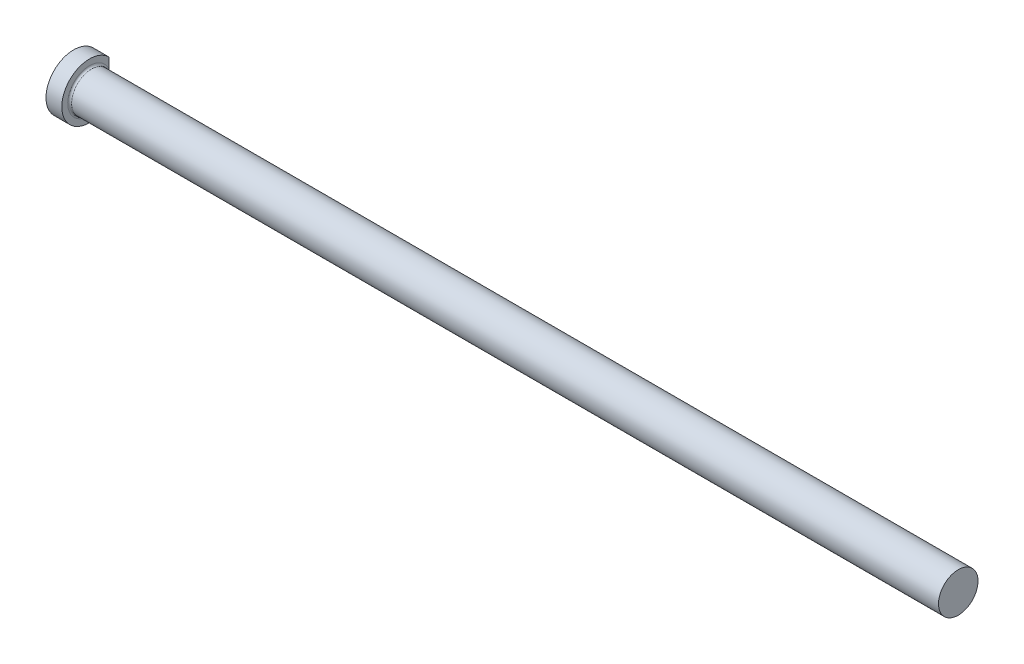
ISO-10303-21;
HEADER;
FILE_DESCRIPTION(('STEP AP214'),'2;1');
FILE_NAME('part.step','',(''),(''),'','','');
FILE_SCHEMA(('AUTOMOTIVE_DESIGN { 1 0 10303 214 1 1 1 1 }'));
ENDSEC;
DATA;
#1=APPLICATION_CONTEXT('core data for automotive mechanical design processes');
#2=APPLICATION_PROTOCOL_DEFINITION('international standard','automotive_design',2000,#1);
#3=PRODUCT_CONTEXT('',#1,'mechanical');
#4=PRODUCT('Part','Part','',(#3));
#5=PRODUCT_RELATED_PRODUCT_CATEGORY('part','',(#4));
#6=PRODUCT_DEFINITION_FORMATION('','',#4);
#7=PRODUCT_DEFINITION_CONTEXT('part definition',#1,'design');
#8=PRODUCT_DEFINITION('design','',#6,#7);
#9=PRODUCT_DEFINITION_SHAPE('','',#8);
#10=(LENGTH_UNIT() NAMED_UNIT(*) SI_UNIT(.MILLI.,.METRE.));
#11=(NAMED_UNIT(*) PLANE_ANGLE_UNIT() SI_UNIT($,.RADIAN.));
#12=(NAMED_UNIT(*) SI_UNIT($,.STERADIAN.) SOLID_ANGLE_UNIT());
#13=UNCERTAINTY_MEASURE_WITH_UNIT(LENGTH_MEASURE(1.E-05),#10,'distance_accuracy_value','');
#14=(GEOMETRIC_REPRESENTATION_CONTEXT(3) GLOBAL_UNCERTAINTY_ASSIGNED_CONTEXT((#13)) GLOBAL_UNIT_ASSIGNED_CONTEXT((#10,
#11,#12)) REPRESENTATION_CONTEXT('',''));
#15=CARTESIAN_POINT('',(0.,0.,0.));
#16=DIRECTION('',(0.,0.,1.));
#17=DIRECTION('',(1.,0.,0.));
#18=AXIS2_PLACEMENT_3D('',#15,#16,#17);
#19=CARTESIAN_POINT('',(0.,0.,0.));
#20=DIRECTION('',(1.,0.,0.));
#21=DIRECTION('',(0.,1.,0.));
#22=AXIS2_PLACEMENT_3D('',#19,#20,#21);
#23=PLANE('',#22);
#24=DIRECTION('',(0.,1.,0.));
#25=VECTOR('',#24,1.);
#26=CARTESIAN_POINT('',(0.,0.,-7.93775399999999));
#27=LINE('',#26,#25);
#28=CARTESIAN_POINT('',(0.,-7.77687068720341,-7.93775399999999));
#29=VERTEX_POINT('',#28);
#30=CARTESIAN_POINT('',(0.,7.77687068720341,-7.93775399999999));
#31=VERTEX_POINT('',#30);
#32=EDGE_CURVE('E49',#29,#31,#27,.T.);
#33=ORIENTED_EDGE('',*,*,#32,.F.);
#34=CARTESIAN_POINT('',(0.,0.,0.));
#35=DIRECTION('',(-1.,0.,0.));
#36=DIRECTION('',(0.,-1.,0.));
#37=AXIS2_PLACEMENT_3D('',#34,#35,#36);
#38=CIRCLE('',#37,11.1125);
#39=EDGE_CURVE('E43',#29,#31,#38,.T.);
#40=ORIENTED_EDGE('',*,*,#39,.T.);
#41=EDGE_LOOP('',(#33,#40));
#42=FACE_BOUND('',#41,.T.);
#43=ADVANCED_FACE('F32',(#42),#23,.F.);
#44=CARTESIAN_POINT('',(355.6,0.,0.));
#45=DIRECTION('',(-1.,0.,0.));
#46=DIRECTION('',(0.,-1.,0.));
#47=AXIS2_PLACEMENT_3D('',#44,#45,#46);
#48=CYLINDRICAL_SURFACE('',#47,11.1125);
#49=DIRECTION('',(-1.,0.,0.));
#50=VECTOR('',#49,1.);
#51=CARTESIAN_POINT('',(355.6,-7.7768706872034,-7.93775399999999));
#52=LINE('',#51,#50);
#53=CARTESIAN_POINT('',(6.35000000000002,-7.77687068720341,-7.93775399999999));
#54=VERTEX_POINT('',#53);
#55=EDGE_CURVE('E87',#54,#29,#52,.T.);
#56=ORIENTED_EDGE('',*,*,#55,.F.);
#57=CARTESIAN_POINT('',(6.35000000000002,0.,0.));
#58=DIRECTION('',(-1.,0.,0.));
#59=DIRECTION('',(0.,-1.,0.));
#60=AXIS2_PLACEMENT_3D('',#57,#58,#59);
#61=CIRCLE('',#60,11.1125);
#62=CARTESIAN_POINT('',(6.35000000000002,7.77687068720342,-7.93775399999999));
#63=VERTEX_POINT('',#62);
#64=EDGE_CURVE('E75',#54,#63,#61,.T.);
#65=ORIENTED_EDGE('',*,*,#64,.T.);
#66=DIRECTION('',(-1.,0.,0.));
#67=VECTOR('',#66,1.);
#68=CARTESIAN_POINT('',(355.6,7.77687068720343,-7.93775399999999));
#69=LINE('',#68,#67);
#70=EDGE_CURVE('E56',#31,#63,#69,.F.);
#71=ORIENTED_EDGE('',*,*,#70,.F.);
#72=ORIENTED_EDGE('',*,*,#39,.F.);
#73=EDGE_LOOP('',(#56,#65,#71,#72));
#74=FACE_BOUND('',#73,.T.);
#75=ADVANCED_FACE('F97',(#74),#48,.T.);
#76=CARTESIAN_POINT('',(6.35,11.1125,0.));
#77=DIRECTION('',(-1.,0.,0.));
#78=DIRECTION('',(0.,-1.,0.));
#79=AXIS2_PLACEMENT_3D('',#76,#77,#78);
#80=PLANE('',#79);
#81=DIRECTION('',(0.,-1.,0.));
#82=VECTOR('',#81,1.);
#83=CARTESIAN_POINT('',(6.35,11.1125,-7.93775399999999));
#84=LINE('',#83,#82);
#85=CARTESIAN_POINT('',(6.35000000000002,3.62159377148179,-7.93775399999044));
#86=VERTEX_POINT('',#85);
#87=EDGE_CURVE('E84',#63,#86,#84,.T.);
#88=ORIENTED_EDGE('',*,*,#87,.F.);
#89=ORIENTED_EDGE('',*,*,#64,.F.);
#90=CARTESIAN_POINT('',(6.35,-3.62159377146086,-7.93775399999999));
#91=VERTEX_POINT('',#90);
#92=EDGE_CURVE('E80',#91,#54,#84,.T.);
#93=ORIENTED_EDGE('',*,*,#92,.F.);
#94=CARTESIAN_POINT('',(6.35000000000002,0.,0.));
#95=DIRECTION('',(-1.,0.,0.));
#96=DIRECTION('',(0.,-1.,0.));
#97=AXIS2_PLACEMENT_3D('',#94,#95,#96);
#98=CIRCLE('',#97,8.7249);
#99=EDGE_CURVE('E70',#91,#86,#98,.T.);
#100=ORIENTED_EDGE('',*,*,#99,.T.);
#101=EDGE_LOOP('',(#88,#89,#93,#100));
#102=FACE_BOUND('',#101,.T.);
#103=ADVANCED_FACE('F81',(#102),#80,.F.);
#104=CARTESIAN_POINT('',(7.1374,0.,0.));
#105=DIRECTION('',(-1.,0.,0.));
#106=DIRECTION('',(0.,-1.,0.));
#107=AXIS2_PLACEMENT_3D('',#104,#105,#106);
#108=TOROIDAL_SURFACE('',#107,8.7249,0.787400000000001);
#109=CARTESIAN_POINT('',(7.13740000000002,0.,0.));
#110=DIRECTION('',(-1.,0.,0.));
#111=DIRECTION('',(0.,-1.,0.));
#112=AXIS2_PLACEMENT_3D('',#109,#110,#111);
#113=CIRCLE('',#112,7.9375);
#114=CARTESIAN_POINT('',(7.13740000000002,-7.9375,0.));
#115=VERTEX_POINT('',#114);
#116=EDGE_CURVE('E76',#115,#115,#113,.T.);
#117=ORIENTED_EDGE('',*,*,#116,.T.);
#118=EDGE_LOOP('',(#117));
#119=FACE_BOUND('',#118,.T.);
#120=CARTESIAN_POINT('',(7.11740163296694,0.,-7.93775399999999));
#121=CARTESIAN_POINT('',(7.11739465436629,-0.00831875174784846,-7.93775399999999));
#122=CARTESIAN_POINT('',(7.11686254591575,-0.0166605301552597,-7.93775399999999));
#123=CARTESIAN_POINT('',(7.1149628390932,-0.0332562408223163,-7.93775399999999));
#124=CARTESIAN_POINT('',(7.11359203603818,-0.041509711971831,-7.93775399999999));
#125=CARTESIAN_POINT('',(7.10880536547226,-0.0662282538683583,-7.93775399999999));
#126=CARTESIAN_POINT('',(7.10472327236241,-0.0825567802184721,-7.93775399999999));
#127=CARTESIAN_POINT('',(7.09173043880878,-0.131601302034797,-7.93775399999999));
#128=CARTESIAN_POINT('',(7.08212745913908,-0.16411222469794,-7.93775399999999));
#129=CARTESIAN_POINT('',(7.0625066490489,-0.229574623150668,-7.93775399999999));
#130=CARTESIAN_POINT('',(7.05248465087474,-0.262524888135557,-7.93775399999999));
#131=CARTESIAN_POINT('',(7.03238611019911,-0.328216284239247,-7.93775399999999));
#132=CARTESIAN_POINT('',(7.02231014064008,-0.360957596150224,-7.93775399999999));
#133=CARTESIAN_POINT('',(6.96866765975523,-0.535318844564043,-7.93775399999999));
#134=CARTESIAN_POINT('',(6.92514937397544,-0.676958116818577,-7.93775399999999));
#135=CARTESIAN_POINT('',(6.83988094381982,-0.961071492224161,-7.93775399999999));
#136=CARTESIAN_POINT('',(6.79813454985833,-1.10354670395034,-7.93775399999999));
#137=CARTESIAN_POINT('',(6.67787276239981,-1.53003573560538,-7.93775399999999));
#138=CARTESIAN_POINT('',(6.60361032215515,-1.8153329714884,-7.93775399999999));
#139=CARTESIAN_POINT('',(6.50819856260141,-2.24883675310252,-7.93775399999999));
#140=CARTESIAN_POINT('',(6.47892220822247,-2.39522816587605,-7.93775399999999));
#141=CARTESIAN_POINT('',(6.42778660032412,-2.68927327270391,-7.93775399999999));
#142=CARTESIAN_POINT('',(6.40592469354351,-2.83692649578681,-7.93775399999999));
#143=CARTESIAN_POINT('',(6.37184973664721,-3.13335997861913,-7.93775399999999));
#144=CARTESIAN_POINT('',(6.35963255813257,-3.28213972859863,-7.93775399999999));
#145=CARTESIAN_POINT('',(6.35089317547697,-3.50560390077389,-7.93775399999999));
#146=CARTESIAN_POINT('',(6.34957585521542,-3.58009961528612,-7.93775399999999));
#147=CARTESIAN_POINT('',(6.35066403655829,-3.72905818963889,-7.93775399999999));
#148=CARTESIAN_POINT('',(6.35306949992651,-3.803521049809,-7.93775399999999));
#149=CARTESIAN_POINT('',(6.36488123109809,-3.9954722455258,-7.93775399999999));
#150=CARTESIAN_POINT('',(6.37754340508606,-4.11281818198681,-7.93775399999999));
#151=CARTESIAN_POINT('',(6.40731512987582,-4.28685788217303,-7.93775399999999));
#152=CARTESIAN_POINT('',(6.41901868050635,-4.34448561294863,-7.93775399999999));
#153=CARTESIAN_POINT('',(6.44665424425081,-4.45870626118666,-7.93775399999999));
#154=CARTESIAN_POINT('',(6.46258356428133,-4.51529981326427,-7.93775399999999));
#155=CARTESIAN_POINT('',(6.49967314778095,-4.62746604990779,-7.93775399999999));
#156=CARTESIAN_POINT('',(6.52088899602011,-4.68302067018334,-7.93775399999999));
#157=CARTESIAN_POINT('',(6.56957225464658,-4.79142309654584,-7.93775399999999));
#158=CARTESIAN_POINT('',(6.59704016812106,-4.84427068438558,-7.93775399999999));
#159=CARTESIAN_POINT('',(6.65288973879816,-4.93444333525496,-7.93775399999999));
#160=CARTESIAN_POINT('',(6.67980774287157,-4.97266427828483,-7.93775399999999));
#161=CARTESIAN_POINT('',(6.73912570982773,-5.04461733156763,-7.93775399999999));
#162=CARTESIAN_POINT('',(6.77151267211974,-5.078359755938,-7.93775399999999));
#163=CARTESIAN_POINT('',(6.83001641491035,-5.1283462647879,-7.93775399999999));
#164=CARTESIAN_POINT('',(6.85440789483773,-5.14659888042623,-7.93775399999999));
#165=CARTESIAN_POINT('',(6.90572230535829,-5.17913635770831,-7.93775399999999));
#166=CARTESIAN_POINT('',(6.93264181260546,-5.19342648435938,-7.93775399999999));
#167=CARTESIAN_POINT('',(6.98430509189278,-5.2151304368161,-7.93775399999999));
#168=CARTESIAN_POINT('',(7.0087432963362,-5.22326519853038,-7.93775399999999));
#169=CARTESIAN_POINT('',(7.05864365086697,-5.23531281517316,-7.93775399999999));
#170=CARTESIAN_POINT('',(7.0841050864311,-5.23922856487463,-7.93775399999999));
#171=CARTESIAN_POINT('',(7.13539651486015,-5.24250311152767,-7.93775399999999));
#172=CARTESIAN_POINT('',(7.16122734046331,-5.24184911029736,-7.93775399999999));
#173=CARTESIAN_POINT('',(7.21237124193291,-5.23601437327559,-7.93775399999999));
#174=CARTESIAN_POINT('',(7.2376841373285,-5.23083208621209,-7.93775399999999));
#175=CARTESIAN_POINT('',(7.28619810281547,-5.21664602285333,-7.93775399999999));
#176=CARTESIAN_POINT('',(7.30944244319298,-5.20778727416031,-7.93775399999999));
#177=CARTESIAN_POINT('',(7.35441891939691,-5.18685621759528,-7.93775399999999));
#178=CARTESIAN_POINT('',(7.37615048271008,-5.17478270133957,-7.93775399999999));
#179=CARTESIAN_POINT('',(7.42999305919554,-5.14028416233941,-7.93775399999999));
#180=CARTESIAN_POINT('',(7.4608530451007,-5.11590713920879,-7.93775399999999));
#181=CARTESIAN_POINT('',(7.51837561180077,-5.06262060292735,-7.93775399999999));
#182=CARTESIAN_POINT('',(7.54502615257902,-5.033698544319,-7.93775399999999));
#183=CARTESIAN_POINT('',(7.61009423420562,-4.95353967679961,-7.93775399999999));
#184=CARTESIAN_POINT('',(7.64532674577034,-4.89973711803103,-7.93775399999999));
#185=CARTESIAN_POINT('',(7.70752548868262,-4.78761031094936,-7.93775399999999));
#186=CARTESIAN_POINT('',(7.73447207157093,-4.72927571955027,-7.93775399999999));
#187=CARTESIAN_POINT('',(7.78036596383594,-4.61331334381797,-7.93775399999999));
#188=CARTESIAN_POINT('',(7.79967345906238,-4.55582513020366,-7.93775399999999));
#189=CARTESIAN_POINT('',(7.83335443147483,-4.4393972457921,-7.93775399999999));
#190=CARTESIAN_POINT('',(7.84772344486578,-4.38045631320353,-7.93775399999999));
#191=CARTESIAN_POINT('',(7.87231446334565,-4.26162941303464,-7.93775399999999));
#192=CARTESIAN_POINT('',(7.88252946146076,-4.20174202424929,-7.93775399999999));
#193=CARTESIAN_POINT('',(7.89938430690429,-4.08149980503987,-7.93775399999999));
#194=CARTESIAN_POINT('',(7.90602535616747,-4.02114513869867,-7.93775399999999));
#195=CARTESIAN_POINT('',(7.91794338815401,-3.8798093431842,-7.93775399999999));
#196=CARTESIAN_POINT('',(7.92200783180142,-3.79872681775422,-7.93775399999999));
#197=CARTESIAN_POINT('',(7.92553011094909,-3.63645129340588,-7.93775399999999));
#198=CARTESIAN_POINT('',(7.92498603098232,-3.55525826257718,-7.93775399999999));
#199=CARTESIAN_POINT('',(7.91751319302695,-3.31163407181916,-7.93775399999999));
#200=CARTESIAN_POINT('',(7.90472943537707,-3.14937912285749,-7.93775399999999));
#201=CARTESIAN_POINT('',(7.8676917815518,-2.82609889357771,-7.93775399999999));
#202=CARTESIAN_POINT('',(7.84342332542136,-2.66507543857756,-7.93775399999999));
#203=CARTESIAN_POINT('',(7.78631819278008,-2.3447455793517,-7.93775399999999));
#204=CARTESIAN_POINT('',(7.75348989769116,-2.18543765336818,-7.93775399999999));
#205=CARTESIAN_POINT('',(7.69810689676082,-1.94158094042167,-7.93775399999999));
#206=CARTESIAN_POINT('',(7.67781446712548,-1.85650278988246,-7.93775399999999));
#207=CARTESIAN_POINT('',(7.63565239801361,-1.68665587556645,-7.93775399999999));
#208=CARTESIAN_POINT('',(7.61378135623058,-1.60188745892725,-7.93775399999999));
#209=CARTESIAN_POINT('',(7.56848359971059,-1.43170349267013,-7.93775399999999));
#210=CARTESIAN_POINT('',(7.54504163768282,-1.34629202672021,-7.93775399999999));
#211=CARTESIAN_POINT('',(7.49717210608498,-1.1760530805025,-7.93775399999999));
#212=CARTESIAN_POINT('',(7.47274807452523,-1.09122460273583,-7.93775399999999));
#213=CARTESIAN_POINT('',(7.43520501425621,-0.96314952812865,-7.93775399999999));
#214=CARTESIAN_POINT('',(7.42238621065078,-0.919814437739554,-7.93775399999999));
#215=CARTESIAN_POINT('',(7.39655831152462,-0.833163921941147,-7.93775399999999));
#216=CARTESIAN_POINT('',(7.38354907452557,-0.789848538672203,-7.93775399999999));
#217=CARTESIAN_POINT('',(7.35720005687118,-0.702651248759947,-7.93775399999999));
#218=CARTESIAN_POINT('',(7.34385820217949,-0.65876997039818,-7.93775399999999));
#219=CARTESIAN_POINT('',(7.31710763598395,-0.571170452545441,-7.93775399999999));
#220=CARTESIAN_POINT('',(7.30369924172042,-0.527452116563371,-7.93775399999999));
#221=CARTESIAN_POINT('',(7.27743659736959,-0.442022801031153,-7.93775399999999));
#222=CARTESIAN_POINT('',(7.26458489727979,-0.400311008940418,-7.93775399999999));
#223=CARTESIAN_POINT('',(7.23880152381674,-0.316406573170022,-7.93775399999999));
#224=CARTESIAN_POINT('',(7.22587053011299,-0.274213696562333,-7.93775399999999));
#225=CARTESIAN_POINT('',(7.20072921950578,-0.191353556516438,-7.93775399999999));
#226=CARTESIAN_POINT('',(7.18851010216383,-0.150688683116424,-7.93775399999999));
#227=CARTESIAN_POINT('',(7.1718383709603,-0.0896856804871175,-7.93775399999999));
#228=CARTESIAN_POINT('',(7.16660973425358,-0.0695879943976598,-7.93775399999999));
#229=CARTESIAN_POINT('',(7.16076608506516,-0.0391365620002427,-7.93775399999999));
#230=CARTESIAN_POINT('',(7.15915541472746,-0.0289999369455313,-7.93775399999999));
#231=CARTESIAN_POINT('',(7.15735845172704,-0.00861600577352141,-7.93775399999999));
#232=CARTESIAN_POINT('',(7.15716659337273,0.00163070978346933,-7.93775399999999));
#233=CARTESIAN_POINT('',(7.15832829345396,0.0222087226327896,-7.93775399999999));
#234=CARTESIAN_POINT('',(7.15971060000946,0.0325380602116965,-7.93775399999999));
#235=CARTESIAN_POINT('',(7.16332304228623,0.0530730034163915,-7.93775399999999));
#236=CARTESIAN_POINT('',(7.16555705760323,0.063277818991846,-7.93775399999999));
#237=CARTESIAN_POINT('',(7.17287200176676,0.0940594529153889,-7.93775399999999));
#238=CARTESIAN_POINT('',(7.17851596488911,0.114497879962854,-7.93775399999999));
#239=CARTESIAN_POINT('',(7.19032620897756,0.155890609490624,-7.93775399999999));
#240=CARTESIAN_POINT('',(7.19650319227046,0.176841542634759,-7.93775399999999));
#241=CARTESIAN_POINT('',(7.20897786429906,0.218569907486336,-7.93775399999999));
#242=CARTESIAN_POINT('',(7.21527458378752,0.239347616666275,-7.93775399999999));
#243=CARTESIAN_POINT('',(7.23483046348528,0.303563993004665,-7.93775399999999));
#244=CARTESIAN_POINT('',(7.2481843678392,0.346972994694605,-7.93775399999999));
#245=CARTESIAN_POINT('',(7.27476203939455,0.433342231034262,-7.93775399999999));
#246=CARTESIAN_POINT('',(7.28798573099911,0.476302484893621,-7.93775399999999));
#247=CARTESIAN_POINT('',(7.31513648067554,0.56474893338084,-7.93775399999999));
#248=CARTESIAN_POINT('',(7.32905958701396,0.610236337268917,-7.93775399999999));
#249=CARTESIAN_POINT('',(7.35681349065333,0.701380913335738,-7.93775399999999));
#250=CARTESIAN_POINT('',(7.37064391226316,0.747038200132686,-7.93775399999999));
#251=CARTESIAN_POINT('',(7.39793267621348,0.837754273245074,-7.93775399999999));
#252=CARTESIAN_POINT('',(7.41139351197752,0.882812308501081,-7.93775399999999));
#253=CARTESIAN_POINT('',(7.43809520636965,0.972955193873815,-7.93775399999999));
#254=CARTESIAN_POINT('',(7.45133622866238,1.01803999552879,-7.93775399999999));
#255=CARTESIAN_POINT('',(7.48540888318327,1.13523564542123,-7.93775399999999));
#256=CARTESIAN_POINT('',(7.50604977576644,1.20740225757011,-7.93775399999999));
#257=CARTESIAN_POINT('',(7.54655729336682,1.35197047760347,-7.93775399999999));
#258=CARTESIAN_POINT('',(7.56642373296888,1.42437213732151,-7.93775399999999));
#259=CARTESIAN_POINT('',(7.62477152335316,1.64250983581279,-7.93775399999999));
#260=CARTESIAN_POINT('',(7.6618395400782,1.78863070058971,-7.93775399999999));
#261=CARTESIAN_POINT('',(7.7303566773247,2.08012980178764,-7.93775399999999));
#262=CARTESIAN_POINT('',(7.76187449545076,2.22549171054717,-7.93775399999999));
#263=CARTESIAN_POINT('',(7.81826525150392,2.51738112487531,-7.93775399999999));
#264=CARTESIAN_POINT('',(7.84314491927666,2.66390729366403,-7.93775399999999));
#265=CARTESIAN_POINT('',(7.87829694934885,2.91543454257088,-7.93775399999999));
#266=CARTESIAN_POINT('',(7.890713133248,3.02013306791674,-7.93775399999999));
#267=CARTESIAN_POINT('',(7.91028048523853,3.23008074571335,-7.93775399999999));
#268=CARTESIAN_POINT('',(7.91742953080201,3.3353301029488,-7.93775399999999));
#269=CARTESIAN_POINT('',(7.92528999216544,3.54605332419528,-7.93775399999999));
#270=CARTESIAN_POINT('',(7.92600419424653,3.6515270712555,-7.93775399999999));
#271=CARTESIAN_POINT('',(7.9194634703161,3.86217000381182,-7.93775399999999));
#272=CARTESIAN_POINT('',(7.91221516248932,3.967339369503,-7.93775399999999));
#273=CARTESIAN_POINT('',(7.88759041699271,4.17694716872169,-7.93775399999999));
#274=CARTESIAN_POINT('',(7.87018356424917,4.28138244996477,-7.93775399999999));
#275=CARTESIAN_POINT('',(7.83406700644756,4.43559669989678,-7.93775399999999));
#276=CARTESIAN_POINT('',(7.8203760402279,4.48655346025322,-7.93775399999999));
#277=CARTESIAN_POINT('',(7.78908771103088,4.58724032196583,-7.93775399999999));
#278=CARTESIAN_POINT('',(7.77149309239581,4.63697125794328,-7.93775399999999));
#279=CARTESIAN_POINT('',(7.73194339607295,4.73395518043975,-7.93775399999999));
#280=CARTESIAN_POINT('',(7.71004692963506,4.78123171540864,-7.93775399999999));
#281=CARTESIAN_POINT('',(7.66087365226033,4.87297749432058,-7.93775399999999));
#282=CARTESIAN_POINT('',(7.63359747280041,4.91744706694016,-7.93775399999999));
#283=CARTESIAN_POINT('',(7.57837986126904,4.99388498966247,-7.93775399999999));
#284=CARTESIAN_POINT('',(7.55152866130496,5.02663140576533,-7.93775399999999));
#285=CARTESIAN_POINT('',(7.49306429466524,5.08758436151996,-7.93775399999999));
#286=CARTESIAN_POINT('',(7.46146198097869,5.11580095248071,-7.93775399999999));
#287=CARTESIAN_POINT('',(7.40417721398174,5.15754291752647,-7.93775399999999));
#288=CARTESIAN_POINT('',(7.37982489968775,5.17288281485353,-7.93775399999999));
#289=CARTESIAN_POINT('',(7.3289847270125,5.19952649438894,-7.93775399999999));
#290=CARTESIAN_POINT('',(7.30249860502,5.21083351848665,-7.93775399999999));
#291=CARTESIAN_POINT('',(7.24762192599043,5.22858234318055,-7.93775399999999));
#292=CARTESIAN_POINT('',(7.2192153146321,5.23497561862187,-7.93775399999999));
#293=CARTESIAN_POINT('',(7.16170062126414,5.24202174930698,-7.93775399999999));
#294=CARTESIAN_POINT('',(7.13259315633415,5.24267948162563,-7.93775399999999));
#295=CARTESIAN_POINT('',(7.07876889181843,5.23850329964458,-7.93775399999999));
#296=CARTESIAN_POINT('',(7.05399146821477,5.23440126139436,-7.93775399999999));
#297=CARTESIAN_POINT('',(7.005441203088,5.22221805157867,-7.93775399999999));
#298=CARTESIAN_POINT('',(6.98166884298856,5.21413499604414,-7.93775399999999));
#299=CARTESIAN_POINT('',(6.92879269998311,5.19165265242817,-7.93775399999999));
#300=CARTESIAN_POINT('',(6.90018447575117,5.17609358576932,-7.93775399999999));
#301=CARTESIAN_POINT('',(6.84586227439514,5.14056942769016,-7.93775399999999));
#302=CARTESIAN_POINT('',(6.82015370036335,5.12059630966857,-7.93775399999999));
#303=CARTESIAN_POINT('',(6.75951629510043,5.06659809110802,-7.93775399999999));
#304=CARTESIAN_POINT('',(6.72640949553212,5.03054208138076,-7.93775399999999));
#305=CARTESIAN_POINT('',(6.66603667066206,4.95384986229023,-7.93775399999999));
#306=CARTESIAN_POINT('',(6.63878582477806,4.91320215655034,-7.93775399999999));
#307=CARTESIAN_POINT('',(6.59224572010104,4.83403499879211,-7.93775399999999));
#308=CARTESIAN_POINT('',(6.57239461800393,4.79583950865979,-7.93775399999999));
#309=CARTESIAN_POINT('',(6.53603892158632,4.71787482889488,-7.93775399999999));
#310=CARTESIAN_POINT('',(6.51953693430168,4.67810444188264,-7.93775399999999));
#311=CARTESIAN_POINT('',(6.47436031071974,4.55713746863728,-7.93775399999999));
#312=CARTESIAN_POINT('',(6.45003233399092,4.4743167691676,-7.93775399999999));
#313=CARTESIAN_POINT('',(6.41021672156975,4.30621759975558,-7.93775399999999));
#314=CARTESIAN_POINT('',(6.39478032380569,4.22092780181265,-7.93775399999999));
#315=CARTESIAN_POINT('',(6.37109601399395,4.04930190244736,-7.93775399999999));
#316=CARTESIAN_POINT('',(6.36285520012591,3.96296485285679,-7.93775399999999));
#317=CARTESIAN_POINT('',(6.35224678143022,3.78972781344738,-7.93775399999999));
#318=CARTESIAN_POINT('',(6.34989496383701,3.70282693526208,-7.93775399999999));
#319=CARTESIAN_POINT('',(6.35011198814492,3.52907987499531,-7.93775399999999));
#320=CARTESIAN_POINT('',(6.35267908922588,3.44223368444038,-7.93775399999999));
#321=CARTESIAN_POINT('',(6.36486585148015,3.21403467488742,-7.93775399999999));
#322=CARTESIAN_POINT('',(6.37791357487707,3.07286717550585,-7.93775399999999));
#323=CARTESIAN_POINT('',(6.41245080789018,2.7914875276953,-7.93775399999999));
#324=CARTESIAN_POINT('',(6.43394844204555,2.65127643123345,-7.93775399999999));
#325=CARTESIAN_POINT('',(6.47126194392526,2.44104579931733,-7.93775399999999));
#326=CARTESIAN_POINT('',(6.48463589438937,2.3705792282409,-7.93775399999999));
#327=CARTESIAN_POINT('',(6.5128654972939,2.22993901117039,-7.93775399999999));
#328=CARTESIAN_POINT('',(6.527721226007,2.15976538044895,-7.93775399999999));
#329=CARTESIAN_POINT('',(6.55867442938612,2.01994939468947,-7.93775399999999));
#330=CARTESIAN_POINT('',(6.57476742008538,1.95030604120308,-7.93775399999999));
#331=CARTESIAN_POINT('',(6.60807147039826,1.81130268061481,-7.93775399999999));
#332=CARTESIAN_POINT('',(6.62528230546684,1.74194261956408,-7.93775399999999));
#333=CARTESIAN_POINT('',(6.66195543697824,1.5984505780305,-7.93775399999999));
#334=CARTESIAN_POINT('',(6.68149049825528,1.52433724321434,-7.93775399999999));
#335=CARTESIAN_POINT('',(6.7215166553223,1.37630245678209,-7.93775399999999));
#336=CARTESIAN_POINT('',(6.74200854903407,1.30238122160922,-7.93775399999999));
#337=CARTESIAN_POINT('',(6.78412798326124,1.15348538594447,-7.93775399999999));
#338=CARTESIAN_POINT('',(6.80576901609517,1.07851461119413,-7.93775399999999));
#339=CARTESIAN_POINT('',(6.84960883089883,0.929018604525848,-7.93775399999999));
#340=CARTESIAN_POINT('',(6.87180542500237,0.854492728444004,-7.93775399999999));
#341=CARTESIAN_POINT('',(6.91456921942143,0.712517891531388,-7.93775399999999));
#342=CARTESIAN_POINT('',(6.93509549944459,0.645056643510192,-7.93775399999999));
#343=CARTESIAN_POINT('',(6.9661954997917,0.543450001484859,-7.93775399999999));
#344=CARTESIAN_POINT('',(6.97668635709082,0.509278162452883,-7.93775399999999));
#345=CARTESIAN_POINT('',(6.9976745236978,0.441014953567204,-7.93775399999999));
#346=CARTESIAN_POINT('',(7.00817176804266,0.406923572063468,-7.93775399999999));
#347=CARTESIAN_POINT('',(7.02832808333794,0.341383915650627,-7.93775399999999));
#348=CARTESIAN_POINT('',(7.03798917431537,0.309935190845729,-7.93775399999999));
#349=CARTESIAN_POINT('',(7.05730529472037,0.246714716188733,-7.93775399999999));
#350=CARTESIAN_POINT('',(7.06695966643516,0.214942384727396,-7.93775399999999));
#351=CARTESIAN_POINT('',(7.08539286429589,0.152842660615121,-7.93775399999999));
#352=CARTESIAN_POINT('',(7.09419152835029,0.122513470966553,-7.93775399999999));
#353=CARTESIAN_POINT('',(7.11019277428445,0.0615467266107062,-7.93775399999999));
#354=CARTESIAN_POINT('',(7.11742758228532,0.0309325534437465,-7.93775399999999));
#355=CARTESIAN_POINT('',(7.11740163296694,0.,-7.93775399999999));
#356=B_SPLINE_CURVE_WITH_KNOTS('',3,(#120,#121,#122,#123,#124,#125,#126,#127,#128,#129,#130,
#131,#132,#133,#134,#135,#136,#137,#138,#139,#140,#141,#142,#143,#144,#145,#146,#147,#148,#149,
#150,#151,#152,#153,#154,#155,#156,#157,#158,#159,#160,#161,#162,#163,#164,#165,#166,#167,#168,
#169,#170,#171,#172,#173,#174,#175,#176,#177,#178,#179,#180,#181,#182,#183,#184,#185,#186,#187,
#188,#189,#190,#191,#192,#193,#194,#195,#196,#197,#198,#199,#200,#201,#202,#203,#204,#205,#206,
#207,#208,#209,#210,#211,#212,#213,#214,#215,#216,#217,#218,#219,#220,#221,#222,#223,#224,#225,
#226,#227,#228,#229,#230,#231,#232,#233,#234,#235,#236,#237,#238,#239,#240,#241,#242,#243,#244,
#245,#246,#247,#248,#249,#250,#251,#252,#253,#254,#255,#256,#257,#258,#259,#260,#261,#262,#263,
#264,#265,#266,#267,#268,#269,#270,#271,#272,#273,#274,#275,#276,#277,#278,#279,#280,#281,#282,
#283,#284,#285,#286,#287,#288,#289,#290,#291,#292,#293,#294,#295,#296,#297,#298,#299,#300,#301,
#302,#303,#304,#305,#306,#307,#308,#309,#310,#311,#312,#313,#314,#315,#316,#317,#318,#319,#320,
#321,#322,#323,#324,#325,#326,#327,#328,#329,#330,#331,#332,#333,#334,#335,#336,#337,#338,#339,
#340,#341,#342,#343,#344,#345,#346,#347,#348,#349,#350,#351,#352,#353,#354,#355),.UNSPECIFIED.,
.T.,.F.,(4,2,2,2,2,2,2,2,2,2,2,2,2,2,2,2,2,2,2,2,2,2,2,2,2,2,2,2,2,2,2,2,2,2,2,2,2,2,2,2,2,2,2,
2,2,2,2,2,2,2,2,2,2,2,2,2,2,2,2,2,2,2,2,2,2,2,2,2,2,2,2,2,2,2,2,2,2,2,2,2,2,2,2,2,2,2,2,2,2,2,2,
2,2,2,2,2,2,2,2,2,2,2,2,2,2,2,2,2,2,2,2,2,2,2,2,2,2,4),(0.,0.0249867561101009,
0.0500695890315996,0.100518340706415,0.202221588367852,0.305541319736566,0.408311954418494,
0.852819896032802,1.29822601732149,2.1820339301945,2.62975936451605,3.07732441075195,
3.52469777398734,3.74813653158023,3.97157299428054,4.32484885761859,4.50114081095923,
4.67732068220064,4.85543751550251,5.03356868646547,5.17343675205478,5.3129768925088,
5.40408479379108,5.49507105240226,5.57201263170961,5.64890138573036,5.72600556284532,
5.80313616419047,5.87747650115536,5.95184482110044,6.06914845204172,6.18678175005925,
6.37863520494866,6.57094015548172,6.7526017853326,6.93442718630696,7.1165580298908,
7.29862758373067,7.54201189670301,7.78549737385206,8.27313056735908,8.76138363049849,
9.24916040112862,9.51154365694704,9.7741629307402,10.0398648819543,10.3046829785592,
10.4402565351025,10.5759365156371,10.7135305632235,10.850715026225,10.9816566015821,
11.1140413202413,11.2414401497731,11.303684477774,11.3344224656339,11.3650398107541,
11.3962253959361,11.4275547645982,11.491139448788,11.5566713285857,11.6218024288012,
11.7580531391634,11.8929011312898,12.0356127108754,12.1787306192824,12.3198073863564,
12.4607739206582,12.685950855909,12.9111813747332,13.3633558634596,13.8094653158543,
14.2551207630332,14.5713111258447,14.8876288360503,15.2038095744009,15.5197277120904,
15.8365966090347,15.9947670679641,16.1528266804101,16.3088659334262,16.4648868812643,
16.5915599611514,16.7179479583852,16.8039943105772,16.8899713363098,16.9767868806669,
17.0635285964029,17.1385195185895,17.2135459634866,17.3107012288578,17.4080346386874,
17.5540643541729,17.70046815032,17.8294186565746,17.9584691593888,18.2166774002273,
18.4763590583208,18.7362965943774,18.9969302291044,19.2574716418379,19.6824158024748,
20.1077695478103,20.3229298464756,20.5381012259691,20.7525265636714,20.9669089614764,
21.1968355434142,21.4269574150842,21.661048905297,21.8943307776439,22.1058731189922,
22.2131130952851,22.3201171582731,22.4188434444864,22.5183539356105,22.6134662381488,
22.7063773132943),.UNSPECIFIED.);
#357=EDGE_CURVE('E12',#86,#91,#356,.T.);
#358=ORIENTED_EDGE('',*,*,#357,.F.);
#359=ORIENTED_EDGE('',*,*,#99,.F.);
#360=EDGE_LOOP('',(#358,#359));
#361=FACE_BOUND('',#360,.T.);
#362=ADVANCED_FACE('F72',(#119,#361),#108,.F.);
#363=CARTESIAN_POINT('',(355.6,0.,0.));
#364=DIRECTION('',(-1.,0.,0.));
#365=DIRECTION('',(0.,-1.,0.));
#366=AXIS2_PLACEMENT_3D('',#363,#364,#365);
#367=CYLINDRICAL_SURFACE('',#366,7.93749999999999);
#368=ORIENTED_EDGE('',*,*,#116,.F.);
#369=EDGE_LOOP('',(#368));
#370=FACE_BOUND('',#369,.T.);
#371=CARTESIAN_POINT('',(355.6,0.,0.));
#372=DIRECTION('',(-1.,0.,0.));
#373=DIRECTION('',(0.,-1.,0.));
#374=AXIS2_PLACEMENT_3D('',#371,#372,#373);
#375=CIRCLE('',#374,7.93749999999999);
#376=CARTESIAN_POINT('',(355.6,-7.93749999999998,0.));
#377=VERTEX_POINT('',#376);
#378=EDGE_CURVE('E92',#377,#377,#375,.T.);
#379=ORIENTED_EDGE('',*,*,#378,.T.);
#380=EDGE_LOOP('',(#379));
#381=FACE_BOUND('',#380,.T.);
#382=ADVANCED_FACE('F107',(#370,#381),#367,.T.);
#383=CARTESIAN_POINT('',(355.6,7.9375,0.));
#384=DIRECTION('',(-1.,0.,0.));
#385=DIRECTION('',(0.,-1.,0.));
#386=AXIS2_PLACEMENT_3D('',#383,#384,#385);
#387=PLANE('',#386);
#388=ORIENTED_EDGE('',*,*,#378,.F.);
#389=EDGE_LOOP('',(#388));
#390=FACE_BOUND('',#389,.T.);
#391=ADVANCED_FACE('F111',(#390),#387,.F.);
#392=CARTESIAN_POINT('',(0.,0.,-7.93775399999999));
#393=DIRECTION('',(0.,0.,-1.));
#394=DIRECTION('',(0.,1.,0.));
#395=AXIS2_PLACEMENT_3D('',#392,#393,#394);
#396=PLANE('',#395);
#397=ORIENTED_EDGE('',*,*,#55,.T.);
#398=ORIENTED_EDGE('',*,*,#32,.T.);
#399=ORIENTED_EDGE('',*,*,#70,.T.);
#400=ORIENTED_EDGE('',*,*,#87,.T.);
#401=ORIENTED_EDGE('',*,*,#357,.T.);
#402=ORIENTED_EDGE('',*,*,#92,.T.);
#403=EDGE_LOOP('',(#397,#398,#399,#400,#401,#402));
#404=FACE_BOUND('',#403,.T.);
#405=ADVANCED_FACE('F86',(#404),#396,.T.);
#406=CLOSED_SHELL('',(#43,#75,#103,#362,#382,#391,#405));
#407=MANIFOLD_SOLID_BREP('B2',#406);
#408=ADVANCED_BREP_SHAPE_REPRESENTATION('',(#18,#407),#14);
#409=SHAPE_DEFINITION_REPRESENTATION(#9,#408);
ENDSEC;
END-ISO-10303-21;
